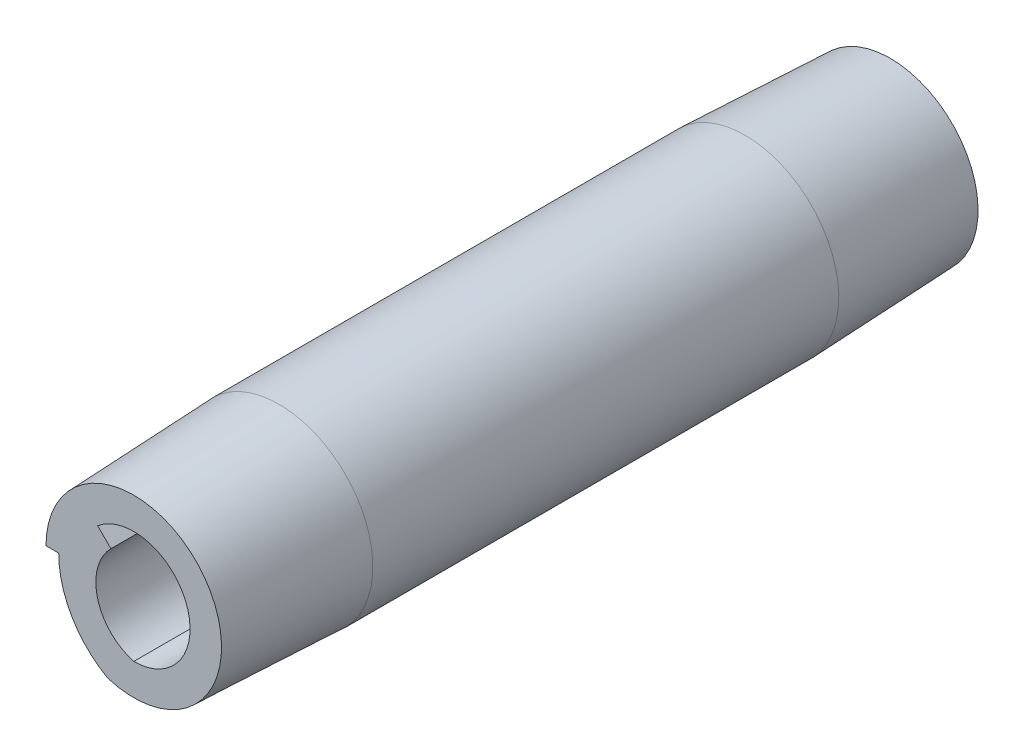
from build123d import *

# Parameters (mm, degrees)
BOSS_EXTRUDE1_DEPTH = 1.5875


with BuildPart() as part:
    # Sketch1 → Boss-Extrude1 (new, symmetric)
    with BuildSketch(Plane.XY):
        with BuildLine():
            Line((-0.3937, 0), (-0.31496, 0))
            ThreePointArc((-0.31496, 0), (-0.226531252, -0.252091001), (0, -0.3937))
            ThreePointArc((0, -0.3937), (0.27838794, 0.27838794), (-0.3937, 0))
        make_face()
        with BuildLine():
            Line((-0.151522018, 0.181220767), (-0.09584443, 0.125543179))
            ThreePointArc((-0.09584443, 0.125543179), (-0.152015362, -0.082916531), (0, -0.23622))
            ThreePointArc((0, -0.23622), (0.222044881, 0.080597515), (-0.151522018, 0.181220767))
        make_face(mode=Mode.SUBTRACT)
    extrude(amount=BOSS_EXTRUDE1_DEPTH, both=True)

    # ChamferSke → Chamfer 2 (revolve, cut)
    with BuildSketch(Plane(origin=(0, 0, 0), x_dir=(0, 0, -1), z_dir=(1, 0, 0))):
        Polygon((-1.5875, 0.978428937), (-1.5875, 0.3683), (-0.9779, 0.3937), (0.9779, 0.3937), (1.5875, 0.3683), (1.5875, 0.978428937), align=None)
    revolve(axis=Axis((0, 0, 0), (0, 0, 1)), mode=Mode.SUBTRACT)


solid = part.part
